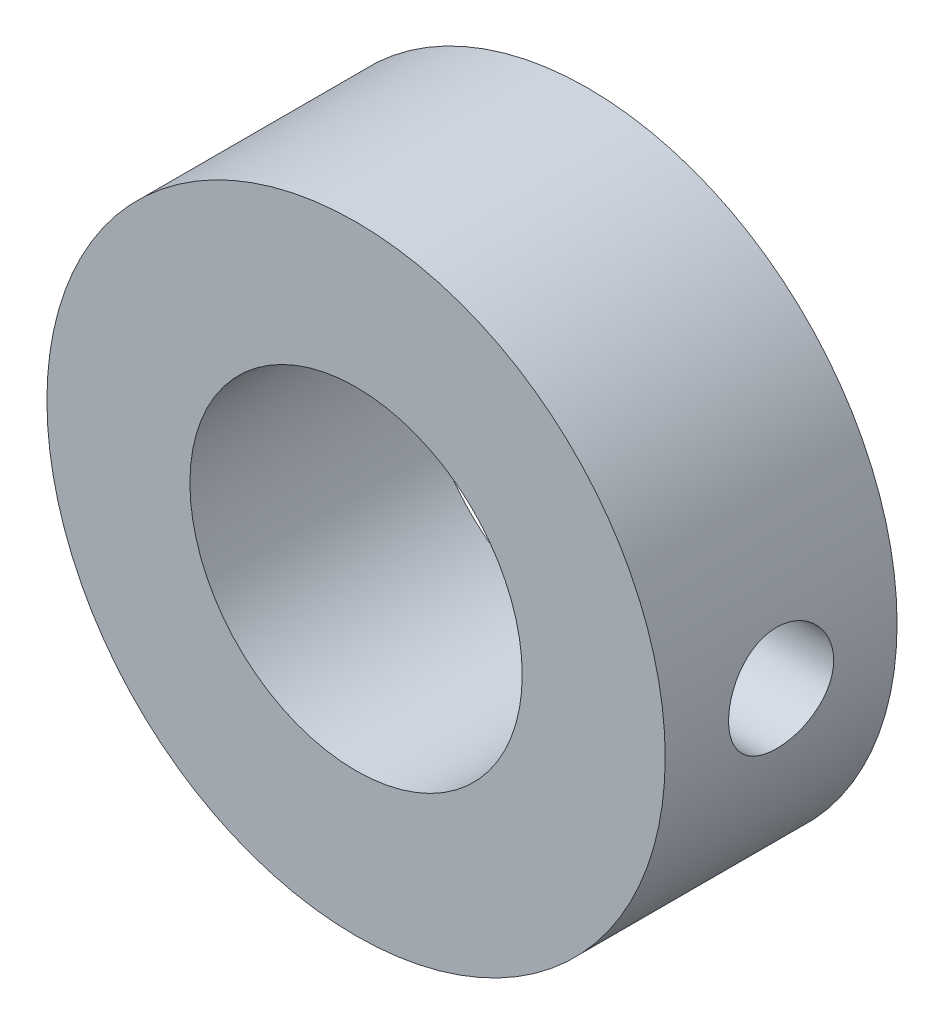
ISO-10303-21;
HEADER;
FILE_DESCRIPTION(('STEP AP214'),'2;1');
FILE_NAME('part.step','',(''),(''),'','','');
FILE_SCHEMA(('AUTOMOTIVE_DESIGN { 1 0 10303 214 1 1 1 1 }'));
ENDSEC;
DATA;
#1=APPLICATION_CONTEXT('core data for automotive mechanical design processes');
#2=APPLICATION_PROTOCOL_DEFINITION('international standard','automotive_design',2000,#1);
#3=PRODUCT_CONTEXT('',#1,'mechanical');
#4=PRODUCT('Part','Part','',(#3));
#5=PRODUCT_RELATED_PRODUCT_CATEGORY('part','',(#4));
#6=PRODUCT_DEFINITION_FORMATION('','',#4);
#7=PRODUCT_DEFINITION_CONTEXT('part definition',#1,'design');
#8=PRODUCT_DEFINITION('design','',#6,#7);
#9=PRODUCT_DEFINITION_SHAPE('','',#8);
#10=(LENGTH_UNIT() NAMED_UNIT(*) SI_UNIT(.MILLI.,.METRE.));
#11=(NAMED_UNIT(*) PLANE_ANGLE_UNIT() SI_UNIT($,.RADIAN.));
#12=(NAMED_UNIT(*) SI_UNIT($,.STERADIAN.) SOLID_ANGLE_UNIT());
#13=UNCERTAINTY_MEASURE_WITH_UNIT(LENGTH_MEASURE(1.E-05),#10,'distance_accuracy_value','');
#14=(GEOMETRIC_REPRESENTATION_CONTEXT(3) GLOBAL_UNCERTAINTY_ASSIGNED_CONTEXT((#13)) GLOBAL_UNIT_ASSIGNED_CONTEXT((#10,
#11,#12)) REPRESENTATION_CONTEXT('',''));
#15=CARTESIAN_POINT('',(0.,0.,0.));
#16=DIRECTION('',(0.,0.,1.));
#17=DIRECTION('',(1.,0.,0.));
#18=AXIS2_PLACEMENT_3D('',#15,#16,#17);
#19=CARTESIAN_POINT('',(0.,0.,7.5));
#20=DIRECTION('',(0.,0.,1.));
#21=DIRECTION('',(1.,0.,0.));
#22=AXIS2_PLACEMENT_3D('',#19,#20,#21);
#23=PLANE('',#22);
#24=CARTESIAN_POINT('',(0.,0.,7.5));
#25=DIRECTION('',(0.,0.,1.));
#26=DIRECTION('',(1.,0.,0.));
#27=AXIS2_PLACEMENT_3D('',#24,#25,#26);
#28=CIRCLE('',#27,20.);
#29=CARTESIAN_POINT('',(20.,0.,7.5));
#30=VERTEX_POINT('',#29);
#31=EDGE_CURVE('E11',#30,#30,#28,.T.);
#32=ORIENTED_EDGE('',*,*,#31,.T.);
#33=EDGE_LOOP('',(#32));
#34=FACE_BOUND('',#33,.T.);
#35=CARTESIAN_POINT('',(0.,0.,7.5));
#36=DIRECTION('',(0.,0.,1.));
#37=DIRECTION('',(1.,0.,0.));
#38=AXIS2_PLACEMENT_3D('',#35,#36,#37);
#39=CIRCLE('',#38,10.75);
#40=CARTESIAN_POINT('',(10.75,0.,7.5));
#41=VERTEX_POINT('',#40);
#42=EDGE_CURVE('E71',#41,#41,#39,.T.);
#43=ORIENTED_EDGE('',*,*,#42,.F.);
#44=EDGE_LOOP('',(#43));
#45=FACE_BOUND('',#44,.T.);
#46=ADVANCED_FACE('F40',(#34,#45),#23,.T.);
#47=CARTESIAN_POINT('',(0.,0.,-7.5));
#48=DIRECTION('',(0.,0.,1.));
#49=DIRECTION('',(1.,0.,0.));
#50=AXIS2_PLACEMENT_3D('',#47,#48,#49);
#51=PLANE('',#50);
#52=CARTESIAN_POINT('',(0.,0.,-7.5));
#53=DIRECTION('',(0.,0.,1.));
#54=DIRECTION('',(1.,0.,0.));
#55=AXIS2_PLACEMENT_3D('',#52,#53,#54);
#56=CIRCLE('',#55,20.);
#57=CARTESIAN_POINT('',(20.,0.,-7.5));
#58=VERTEX_POINT('',#57);
#59=EDGE_CURVE('E50',#58,#58,#56,.T.);
#60=ORIENTED_EDGE('',*,*,#59,.F.);
#61=EDGE_LOOP('',(#60));
#62=FACE_BOUND('',#61,.T.);
#63=CARTESIAN_POINT('',(0.,0.,-7.5));
#64=DIRECTION('',(0.,0.,1.));
#65=DIRECTION('',(1.,0.,0.));
#66=AXIS2_PLACEMENT_3D('',#63,#64,#65);
#67=CIRCLE('',#66,10.75);
#68=CARTESIAN_POINT('',(10.75,0.,-7.5));
#69=VERTEX_POINT('',#68);
#70=EDGE_CURVE('E66',#69,#69,#67,.T.);
#71=ORIENTED_EDGE('',*,*,#70,.T.);
#72=EDGE_LOOP('',(#71));
#73=FACE_BOUND('',#72,.T.);
#74=ADVANCED_FACE('F91',(#62,#73),#51,.F.);
#75=CARTESIAN_POINT('',(0.,0.,7.5));
#76=DIRECTION('',(0.,0.,-1.));
#77=DIRECTION('',(-1.,0.,0.));
#78=AXIS2_PLACEMENT_3D('',#75,#76,#77);
#79=CYLINDRICAL_SURFACE('',#78,20.);
#80=CARTESIAN_POINT('',(20.,0.,-3.4));
#81=CARTESIAN_POINT('',(19.9999967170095,-0.189515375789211,-3.39999245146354));
#82=CARTESIAN_POINT('',(19.9972782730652,-0.379132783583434,-3.38410114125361));
#83=CARTESIAN_POINT('',(19.9866956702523,-0.75304558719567,-3.32098440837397));
#84=CARTESIAN_POINT('',(19.9788268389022,-0.937335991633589,-3.27373053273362));
#85=CARTESIAN_POINT('',(19.9588256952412,-1.29513126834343,-3.1493598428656));
#86=CARTESIAN_POINT('',(19.9466969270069,-1.46864496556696,-3.07226784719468));
#87=CARTESIAN_POINT('',(19.9195081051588,-1.80025336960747,-2.89047511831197));
#88=CARTESIAN_POINT('',(19.9044483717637,-1.9583497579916,-2.78577740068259));
#89=CARTESIAN_POINT('',(19.8728987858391,-2.25622678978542,-2.55063968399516));
#90=CARTESIAN_POINT('',(19.8563974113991,-2.39583214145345,-2.41997914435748));
#91=CARTESIAN_POINT('',(19.823912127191,-2.65124968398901,-2.13709942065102));
#92=CARTESIAN_POINT('',(19.8079282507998,-2.76706034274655,-1.98487884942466));
#93=CARTESIAN_POINT('',(19.7781760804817,-2.97230763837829,-1.66199057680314));
#94=CARTESIAN_POINT('',(19.7644226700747,-3.06157017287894,-1.49121071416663));
#95=CARTESIAN_POINT('',(19.7408488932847,-3.21007385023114,-1.13680778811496));
#96=CARTESIAN_POINT('',(19.731028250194,-3.26931710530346,-0.953185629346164));
#97=CARTESIAN_POINT('',(19.7165468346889,-3.3555466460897,-0.580171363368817));
#98=CARTESIAN_POINT('',(19.7118376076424,-3.38283604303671,-0.390851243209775));
#99=CARTESIAN_POINT('',(19.7079657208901,-3.40532318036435,-0.0102651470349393));
#100=CARTESIAN_POINT('',(19.7088026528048,-3.40052328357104,0.181000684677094));
#101=CARTESIAN_POINT('',(19.7158843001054,-3.35921480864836,0.557880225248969));
#102=CARTESIAN_POINT('',(19.7220708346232,-3.32304736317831,0.743532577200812));
#103=CARTESIAN_POINT('',(19.7390635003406,-3.22056609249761,1.10609520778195));
#104=CARTESIAN_POINT('',(19.7498697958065,-3.15425119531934,1.28300517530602));
#105=CARTESIAN_POINT('',(19.7749469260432,-2.99301347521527,1.62407892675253));
#106=CARTESIAN_POINT('',(19.7892347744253,-2.89794959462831,1.78817472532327));
#107=CARTESIAN_POINT('',(19.8196534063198,-2.68201251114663,2.09821471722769));
#108=CARTESIAN_POINT('',(19.8357843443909,-2.56113714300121,2.2441573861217));
#109=CARTESIAN_POINT('',(19.86832692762,-2.29515259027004,2.51572243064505));
#110=CARTESIAN_POINT('',(19.8847395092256,-2.14975085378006,2.64105833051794));
#111=CARTESIAN_POINT('',(19.9158038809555,-1.83982880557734,2.8655971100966));
#112=CARTESIAN_POINT('',(19.9304556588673,-1.6753083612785,2.96479980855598));
#113=CARTESIAN_POINT('',(19.9563696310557,-1.33154518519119,3.13428469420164));
#114=CARTESIAN_POINT('',(19.9676287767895,-1.15228939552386,3.20454089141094));
#115=CARTESIAN_POINT('',(19.9854645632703,-0.784288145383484,3.31386899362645));
#116=CARTESIAN_POINT('',(19.9920416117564,-0.595543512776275,3.35294361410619));
#117=CARTESIAN_POINT('',(19.9997171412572,-0.216390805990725,3.39840944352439));
#118=CARTESIAN_POINT('',(20.0008815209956,-0.026031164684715,3.40519380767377));
#119=CARTESIAN_POINT('',(19.9977812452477,0.353104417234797,3.3869356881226));
#120=CARTESIAN_POINT('',(19.9935168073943,0.541880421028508,3.36189448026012));
#121=CARTESIAN_POINT('',(19.9800788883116,0.911270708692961,3.28102303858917));
#122=CARTESIAN_POINT('',(19.9709365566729,1.09192898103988,3.22538810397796));
#123=CARTESIAN_POINT('',(19.9487638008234,1.44135414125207,3.08511715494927));
#124=CARTESIAN_POINT('',(19.9357331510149,1.61012033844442,3.00047945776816));
#125=CARTESIAN_POINT('',(19.9070655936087,1.93267389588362,2.8037097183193));
#126=CARTESIAN_POINT('',(19.8914059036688,2.08630987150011,2.69133290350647));
#127=CARTESIAN_POINT('',(19.8592843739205,2.3726835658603,2.44261075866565));
#128=CARTESIAN_POINT('',(19.8428224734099,2.50541969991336,2.30626361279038));
#129=CARTESIAN_POINT('',(19.8107379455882,2.74768877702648,2.01170528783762));
#130=CARTESIAN_POINT('',(19.7951263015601,2.85695566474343,1.85327389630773));
#131=CARTESIAN_POINT('',(19.7667173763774,3.04732454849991,1.52007387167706));
#132=CARTESIAN_POINT('',(19.7539200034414,3.12842746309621,1.34530577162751));
#133=CARTESIAN_POINT('',(19.7326715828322,3.25977140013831,0.985126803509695));
#134=CARTESIAN_POINT('',(19.7242021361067,3.31014324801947,0.7997647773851));
#135=CARTESIAN_POINT('',(19.7125229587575,3.37900571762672,0.423054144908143));
#136=CARTESIAN_POINT('',(19.709312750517,3.39749923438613,0.231706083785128));
#137=CARTESIAN_POINT('',(19.7085366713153,3.40199685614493,-0.148887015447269));
#138=CARTESIAN_POINT('',(19.710898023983,3.38841986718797,-0.3381270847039));
#139=CARTESIAN_POINT('',(19.720839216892,3.33006941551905,-0.711587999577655));
#140=CARTESIAN_POINT('',(19.7284190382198,3.28529606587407,-0.895808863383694));
#141=CARTESIAN_POINT('',(19.747914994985,3.1659868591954,-1.25383033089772));
#142=CARTESIAN_POINT('',(19.7598256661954,3.09148849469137,-1.42764374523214));
#143=CARTESIAN_POINT('',(19.786646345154,2.91488740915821,-1.76037264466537));
#144=CARTESIAN_POINT('',(19.8015565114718,2.81278322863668,-1.9192873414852));
#145=CARTESIAN_POINT('',(19.832926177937,2.58237970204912,-2.21982154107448));
#146=CARTESIAN_POINT('',(19.8494025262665,2.45377265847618,-2.36120342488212));
#147=CARTESIAN_POINT('',(19.8819150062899,2.17466196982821,-2.62052247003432));
#148=CARTESIAN_POINT('',(19.8979510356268,2.02415328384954,-2.73845421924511));
#149=CARTESIAN_POINT('',(19.9279104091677,1.70421917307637,-2.94830591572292));
#150=CARTESIAN_POINT('',(19.9418176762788,1.53466510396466,-3.0400320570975));
#151=CARTESIAN_POINT('',(19.9657961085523,1.1823851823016,-3.19355742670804));
#152=CARTESIAN_POINT('',(19.9758710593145,0.99967254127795,-3.25538620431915));
#153=CARTESIAN_POINT('',(19.9888729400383,0.68022914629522,-3.33407264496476));
#154=CARTESIAN_POINT('',(19.993023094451,0.545421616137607,-3.35875541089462));
#155=CARTESIAN_POINT('',(19.9985877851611,0.273760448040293,-3.39172166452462));
#156=CARTESIAN_POINT('',(20.0000023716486,0.136906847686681,-3.40000545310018));
#157=CARTESIAN_POINT('',(20.,0.,-3.4));
#158=B_SPLINE_CURVE_WITH_KNOTS('',3,(#80,#81,#82,#83,#84,#85,#86,#87,#88,#89,#90,#91,#92,#93,
#94,#95,#96,#97,#98,#99,#100,#101,#102,#103,#104,#105,#106,#107,#108,#109,#110,#111,#112,#113,
#114,#115,#116,#117,#118,#119,#120,#121,#122,#123,#124,#125,#126,#127,#128,#129,#130,#131,#132,
#133,#134,#135,#136,#137,#138,#139,#140,#141,#142,#143,#144,#145,#146,#147,#148,#149,#150,#151,
#152,#153,#154,#155,#156,#157),.UNSPECIFIED.,.T.,.F.,(4,2,2,2,2,2,2,2,2,2,2,2,2,2,2,2,2,2,2,2,2,
2,2,2,2,2,2,2,2,2,2,2,2,2,2,2,2,2,4),(0.,0.568045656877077,1.13660736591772,1.70469717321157,
2.27272494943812,2.84580168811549,3.41891531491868,3.99570849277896,4.57246108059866,
5.14369715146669,5.71489116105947,6.27995004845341,6.84502902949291,7.41292685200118,
7.98087233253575,8.55614566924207,9.13142299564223,9.70721572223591,10.2829582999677,
10.8516725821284,11.4203640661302,11.9854666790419,12.5506020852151,13.1209146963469,
13.691270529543,14.267785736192,14.8442821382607,15.4183068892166,15.9922795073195,
16.5587964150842,17.1253112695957,17.6911138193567,18.2569462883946,18.8297610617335,
19.4027078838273,19.9797883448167,20.5562972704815,20.9666638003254,21.3770228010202),.UNSPECIFIED.);
#159=CARTESIAN_POINT('',(20.,0.,3.4));
#160=VERTEX_POINT('',#159);
#161=CARTESIAN_POINT('',(20.,0.,-3.4));
#162=VERTEX_POINT('',#161);
#163=EDGE_CURVE('E58',#160,#162,#158,.T.);
#164=ORIENTED_EDGE('',*,*,#163,.T.);
#165=EDGE_CURVE('E56',#162,#160,#158,.T.);
#166=ORIENTED_EDGE('',*,*,#165,.T.);
#167=EDGE_LOOP('',(#164,#166));
#168=FACE_BOUND('',#167,.T.);
#169=ORIENTED_EDGE('',*,*,#31,.F.);
#170=EDGE_LOOP('',(#169));
#171=FACE_BOUND('',#170,.T.);
#172=ORIENTED_EDGE('',*,*,#59,.T.);
#173=EDGE_LOOP('',(#172));
#174=FACE_BOUND('',#173,.T.);
#175=ADVANCED_FACE('F42',(#168,#171,#174),#79,.T.);
#176=CARTESIAN_POINT('',(0.,0.,7.5));
#177=DIRECTION('',(0.,0.,-1.));
#178=DIRECTION('',(-1.,0.,0.));
#179=AXIS2_PLACEMENT_3D('',#176,#177,#178);
#180=CYLINDRICAL_SURFACE('',#179,10.75);
#181=CARTESIAN_POINT('',(10.75,0.,-3.4));
#182=CARTESIAN_POINT('',(10.7499993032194,-0.186041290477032,-3.39999912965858));
#183=CARTESIAN_POINT('',(10.7451251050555,-0.372092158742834,-3.38468007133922));
#184=CARTESIAN_POINT('',(10.7261589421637,-0.738745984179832,-3.32397393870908));
#185=CARTESIAN_POINT('',(10.7120650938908,-0.919347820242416,-3.27858072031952));
#186=CARTESIAN_POINT('',(10.6761978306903,-1.26976365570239,-3.15941516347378));
#187=CARTESIAN_POINT('',(10.6544364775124,-1.43959410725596,-3.08568738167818));
#188=CARTESIAN_POINT('',(10.605476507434,-1.76448140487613,-2.91213723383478));
#189=CARTESIAN_POINT('',(10.5782769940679,-1.91953580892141,-2.81231056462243));
#190=CARTESIAN_POINT('',(10.520363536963,-2.21536284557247,-2.58608182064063));
#191=CARTESIAN_POINT('',(10.4895716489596,-2.35560396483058,-2.45900475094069));
#192=CARTESIAN_POINT('',(10.4283912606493,-2.61318137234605,-2.18331926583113));
#193=CARTESIAN_POINT('',(10.398002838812,-2.73051326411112,-2.03470672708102));
#194=CARTESIAN_POINT('',(10.3402299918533,-2.94185030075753,-1.71553512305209));
#195=CARTESIAN_POINT('',(10.3129415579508,-3.0351867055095,-1.54451422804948));
#196=CARTESIAN_POINT('',(10.2656329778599,-3.19155161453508,-1.18820052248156));
#197=CARTESIAN_POINT('',(10.2456108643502,-3.2545883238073,-1.00291159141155));
#198=CARTESIAN_POINT('',(10.2159181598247,-3.34661087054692,-0.629327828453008));
#199=CARTESIAN_POINT('',(10.2059480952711,-3.37658448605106,-0.44130078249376));
#200=CARTESIAN_POINT('',(10.1965997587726,-3.40471635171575,-0.0626426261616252));
#201=CARTESIAN_POINT('',(10.1972185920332,-3.40288329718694,0.127987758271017));
#202=CARTESIAN_POINT('',(10.2087141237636,-3.36822542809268,0.498226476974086));
#203=CARTESIAN_POINT('',(10.2191732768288,-3.33666206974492,0.677968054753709));
#204=CARTESIAN_POINT('',(10.2484917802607,-3.24548706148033,1.02946066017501));
#205=CARTESIAN_POINT('',(10.2673520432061,-3.18587236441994,1.20121081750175));
#206=CARTESIAN_POINT('',(10.3116636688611,-3.03940775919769,1.53482552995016));
#207=CARTESIAN_POINT('',(10.3372089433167,-2.95216573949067,1.69650492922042));
#208=CARTESIAN_POINT('',(10.391969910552,-2.75319525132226,2.00334046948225));
#209=CARTESIAN_POINT('',(10.4211865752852,-2.6414602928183,2.14849221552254));
#210=CARTESIAN_POINT('',(10.4816677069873,-2.39050893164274,2.42527620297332));
#211=CARTESIAN_POINT('',(10.5129640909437,-2.25025290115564,2.55596064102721));
#212=CARTESIAN_POINT('',(10.5728768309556,-1.94942715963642,2.7921873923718));
#213=CARTESIAN_POINT('',(10.6014929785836,-1.78885587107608,2.89772775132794));
#214=CARTESIAN_POINT('',(10.6531341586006,-1.45009867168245,3.08133368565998));
#215=CARTESIAN_POINT('',(10.6761117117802,-1.27177984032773,3.15916827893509));
#216=CARTESIAN_POINT('',(10.7135437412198,-0.903683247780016,3.28345233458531));
#217=CARTESIAN_POINT('',(10.7280008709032,-0.713909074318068,3.32991156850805));
#218=CARTESIAN_POINT('',(10.7463339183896,-0.336330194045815,3.38850015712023));
#219=CARTESIAN_POINT('',(10.7506049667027,-0.148743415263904,3.4019121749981));
#220=CARTESIAN_POINT('',(10.7492561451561,0.226023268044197,3.39764868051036));
#221=CARTESIAN_POINT('',(10.7436377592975,0.413203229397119,3.37997783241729));
#222=CARTESIAN_POINT('',(10.7234012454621,0.776862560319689,3.31507746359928));
#223=CARTESIAN_POINT('',(10.7090169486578,0.953493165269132,3.26861542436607));
#224=CARTESIAN_POINT('',(10.6729377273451,1.29639888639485,3.1483921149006));
#225=CARTESIAN_POINT('',(10.6512418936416,1.46267271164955,3.07462744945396));
#226=CARTESIAN_POINT('',(10.6020975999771,1.78472276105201,2.89985519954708));
#227=CARTESIAN_POINT('',(10.5745200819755,1.94013743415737,2.79821868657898));
#228=CARTESIAN_POINT('',(10.516761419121,2.23213348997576,2.57133952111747));
#229=CARTESIAN_POINT('',(10.4865795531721,2.36870962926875,2.4460903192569));
#230=CARTESIAN_POINT('',(10.4254675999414,2.62491764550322,2.16950739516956));
#231=CARTESIAN_POINT('',(10.394556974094,2.74363500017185,2.01732026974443));
#232=CARTESIAN_POINT('',(10.3367649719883,2.95393381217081,1.694513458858));
#233=CARTESIAN_POINT('',(10.3098835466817,3.04551559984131,1.52389399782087));
#234=CARTESIAN_POINT('',(10.2634868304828,3.19839592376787,1.16935116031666));
#235=CARTESIAN_POINT('',(10.2439451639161,3.25980314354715,0.985478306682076));
#236=CARTESIAN_POINT('',(10.2146269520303,3.35055440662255,0.60925461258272));
#237=CARTESIAN_POINT('',(10.2048465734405,3.37991103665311,0.416907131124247));
#238=CARTESIAN_POINT('',(10.1965643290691,3.40480964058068,0.0387734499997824));
#239=CARTESIAN_POINT('',(10.1975610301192,3.40185491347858,-0.146903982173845));
#240=CARTESIAN_POINT('',(10.2094986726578,3.36585624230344,-0.514976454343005));
#241=CARTESIAN_POINT('',(10.2204391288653,3.33281376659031,-0.697371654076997));
#242=CARTESIAN_POINT('',(10.2506769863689,3.23859451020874,-1.05094203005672));
#243=CARTESIAN_POINT('',(10.2698433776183,3.17785789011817,-1.2222465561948));
#244=CARTESIAN_POINT('',(10.3143373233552,3.03032259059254,-1.55236965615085));
#245=CARTESIAN_POINT('',(10.3396661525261,2.94351851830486,-1.71118563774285));
#246=CARTESIAN_POINT('',(10.3948930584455,2.74225922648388,-2.01869146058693));
#247=CARTESIAN_POINT('',(10.4249332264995,2.62683808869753,-2.16672351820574));
#248=CARTESIAN_POINT('',(10.4855553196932,2.37330878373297,-2.44180458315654));
#249=CARTESIAN_POINT('',(10.5161373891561,2.23519448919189,-2.56884790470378));
#250=CARTESIAN_POINT('',(10.5756355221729,1.93459432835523,-2.80264167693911));
#251=CARTESIAN_POINT('',(10.6044605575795,1.77144338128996,-2.908562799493));
#252=CARTESIAN_POINT('',(10.6560384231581,1.42874148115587,-3.09133860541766));
#253=CARTESIAN_POINT('',(10.6787934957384,1.24919661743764,-3.16820402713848));
#254=CARTESIAN_POINT('',(10.7142069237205,0.893171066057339,-3.28551486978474));
#255=CARTESIAN_POINT('',(10.7275109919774,0.717530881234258,-3.3283207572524));
#256=CARTESIAN_POINT('',(10.7454069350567,0.361262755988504,-3.3855607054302));
#257=CARTESIAN_POINT('',(10.7500006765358,0.180635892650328,-3.4000008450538));
#258=CARTESIAN_POINT('',(10.75,0.,-3.4));
#259=B_SPLINE_CURVE_WITH_KNOTS('',3,(#181,#182,#183,#184,#185,#186,#187,#188,#189,#190,#191,
#192,#193,#194,#195,#196,#197,#198,#199,#200,#201,#202,#203,#204,#205,#206,#207,#208,#209,#210,
#211,#212,#213,#214,#215,#216,#217,#218,#219,#220,#221,#222,#223,#224,#225,#226,#227,#228,#229,
#230,#231,#232,#233,#234,#235,#236,#237,#238,#239,#240,#241,#242,#243,#244,#245,#246,#247,#248,
#249,#250,#251,#252,#253,#254,#255,#256,#257,#258),.UNSPECIFIED.,.T.,.F.,(4,2,2,2,2,2,2,2,2,2,2,
2,2,2,2,2,2,2,2,2,2,2,2,2,2,2,2,2,2,2,2,2,2,2,2,2,2,2,4),(0.,0.557459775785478,1.1150334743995,
1.67173394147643,2.22852625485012,2.80115197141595,3.3738874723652,3.96118107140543,
4.54831554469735,5.11738942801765,5.68630774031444,6.2321248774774,6.77800131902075,
7.33200149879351,7.88614865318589,8.46617207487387,9.04624056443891,9.63103765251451,
10.2156525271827,10.7771918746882,11.3386469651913,11.8857435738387,12.432908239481,
12.9936117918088,13.5544710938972,14.1381304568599,14.7217827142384,15.3033170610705,
15.8846229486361,16.4390029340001,16.9933558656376,17.5391897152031,18.0851365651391,
18.6528885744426,19.2207941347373,19.8078612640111,20.3947112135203,20.9360901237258,
21.4773530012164),.UNSPECIFIED.);
#260=CARTESIAN_POINT('',(10.75,0.,-3.4));
#261=VERTEX_POINT('',#260);
#262=EDGE_CURVE('E62',#261,#261,#259,.T.);
#263=ORIENTED_EDGE('',*,*,#262,.F.);
#264=EDGE_LOOP('',(#263));
#265=FACE_BOUND('',#264,.T.);
#266=ORIENTED_EDGE('',*,*,#42,.T.);
#267=EDGE_LOOP('',(#266));
#268=FACE_BOUND('',#267,.T.);
#269=ORIENTED_EDGE('',*,*,#70,.F.);
#270=EDGE_LOOP('',(#269));
#271=FACE_BOUND('',#270,.T.);
#272=ADVANCED_FACE('F83',(#265,#268,#271),#180,.F.);
#273=CARTESIAN_POINT('',(20.,0.,0.));
#274=DIRECTION('',(1.,0.,0.));
#275=DIRECTION('',(0.,0.,-1.));
#276=AXIS2_PLACEMENT_3D('',#273,#274,#275);
#277=CYLINDRICAL_SURFACE('',#276,3.4);
#278=ORIENTED_EDGE('',*,*,#262,.T.);
#279=EDGE_LOOP('',(#278));
#280=FACE_BOUND('',#279,.T.);
#281=ORIENTED_EDGE('',*,*,#163,.F.);
#282=ORIENTED_EDGE('',*,*,#165,.F.);
#283=EDGE_LOOP('',(#281,#282));
#284=FACE_BOUND('',#283,.T.);
#285=ADVANCED_FACE('F59',(#280,#284),#277,.F.);
#286=CLOSED_SHELL('',(#46,#74,#175,#272,#285));
#287=MANIFOLD_SOLID_BREP('B2',#286);
#288=ADVANCED_BREP_SHAPE_REPRESENTATION('',(#18,#287),#14);
#289=SHAPE_DEFINITION_REPRESENTATION(#9,#288);
ENDSEC;
END-ISO-10303-21;
